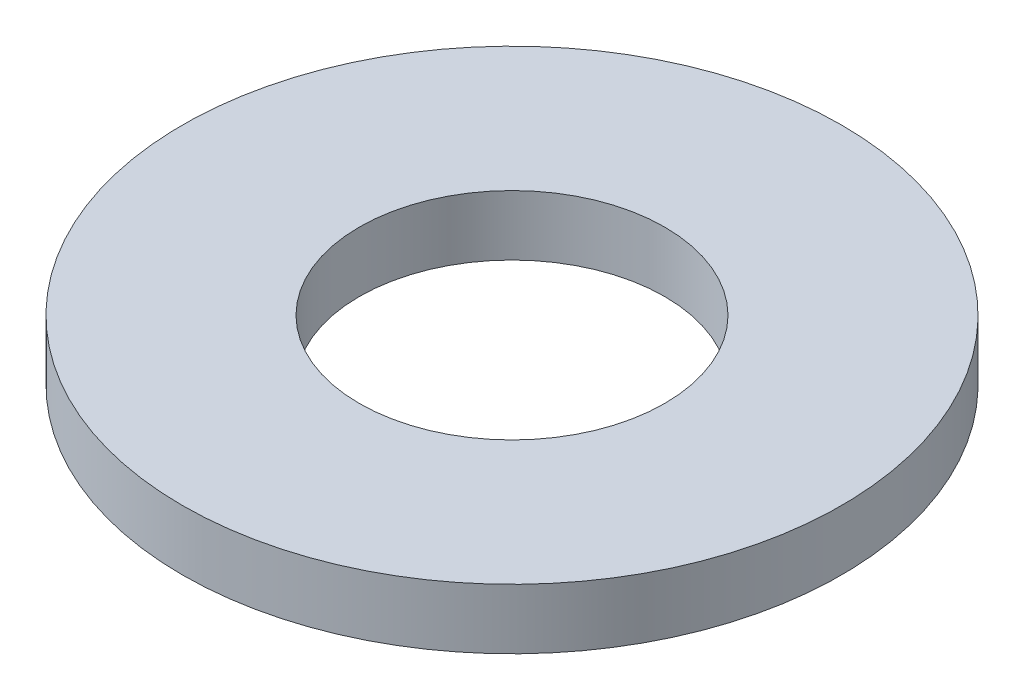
ISO-10303-21;
HEADER;
FILE_DESCRIPTION(('STEP AP214'),'2;1');
FILE_NAME('part.step','',(''),(''),'','','');
FILE_SCHEMA(('AUTOMOTIVE_DESIGN { 1 0 10303 214 1 1 1 1 }'));
ENDSEC;
DATA;
#1=APPLICATION_CONTEXT('core data for automotive mechanical design processes');
#2=APPLICATION_PROTOCOL_DEFINITION('international standard','automotive_design',2000,#1);
#3=PRODUCT_CONTEXT('',#1,'mechanical');
#4=PRODUCT('Part','Part','',(#3));
#5=PRODUCT_RELATED_PRODUCT_CATEGORY('part','',(#4));
#6=PRODUCT_DEFINITION_FORMATION('','',#4);
#7=PRODUCT_DEFINITION_CONTEXT('part definition',#1,'design');
#8=PRODUCT_DEFINITION('design','',#6,#7);
#9=PRODUCT_DEFINITION_SHAPE('','',#8);
#10=(LENGTH_UNIT() NAMED_UNIT(*) SI_UNIT(.MILLI.,.METRE.));
#11=(NAMED_UNIT(*) PLANE_ANGLE_UNIT() SI_UNIT($,.RADIAN.));
#12=(NAMED_UNIT(*) SI_UNIT($,.STERADIAN.) SOLID_ANGLE_UNIT());
#13=UNCERTAINTY_MEASURE_WITH_UNIT(LENGTH_MEASURE(1.E-05),#10,'distance_accuracy_value','');
#14=(GEOMETRIC_REPRESENTATION_CONTEXT(3) GLOBAL_UNCERTAINTY_ASSIGNED_CONTEXT((#13)) GLOBAL_UNIT_ASSIGNED_CONTEXT((#10,
#11,#12)) REPRESENTATION_CONTEXT('',''));
#15=CARTESIAN_POINT('',(0.,0.,0.));
#16=DIRECTION('',(0.,0.,1.));
#17=DIRECTION('',(1.,0.,0.));
#18=AXIS2_PLACEMENT_3D('',#15,#16,#17);
#19=CARTESIAN_POINT('',(0.,0.,0.));
#20=DIRECTION('',(0.,1.,0.));
#21=DIRECTION('',(1.,0.,0.));
#22=AXIS2_PLACEMENT_3D('',#19,#20,#21);
#23=PLANE('',#22);
#24=CARTESIAN_POINT('',(0.,0.,0.));
#25=DIRECTION('',(0.,1.,0.));
#26=DIRECTION('',(0.,0.,1.));
#27=AXIS2_PLACEMENT_3D('',#24,#25,#26);
#28=CIRCLE('',#27,2.5781);
#29=CARTESIAN_POINT('',(0.,0.,2.5781));
#30=VERTEX_POINT('',#29);
#31=EDGE_CURVE('E33',#30,#30,#28,.T.);
#32=ORIENTED_EDGE('',*,*,#31,.T.);
#33=EDGE_LOOP('',(#32));
#34=FACE_BOUND('',#33,.T.);
#35=CARTESIAN_POINT('',(0.,0.,0.));
#36=DIRECTION('',(0.,1.,0.));
#37=DIRECTION('',(0.,0.,1.));
#38=AXIS2_PLACEMENT_3D('',#35,#36,#37);
#39=CIRCLE('',#38,5.5626);
#40=CARTESIAN_POINT('',(0.,0.,5.5626));
#41=VERTEX_POINT('',#40);
#42=EDGE_CURVE('E10',#41,#41,#39,.T.);
#43=ORIENTED_EDGE('',*,*,#42,.F.);
#44=EDGE_LOOP('',(#43));
#45=FACE_BOUND('',#44,.T.);
#46=ADVANCED_FACE('F15',(#34,#45),#23,.F.);
#47=CARTESIAN_POINT('',(0.,1.016,0.));
#48=DIRECTION('',(0.,1.,0.));
#49=DIRECTION('',(1.,0.,0.));
#50=AXIS2_PLACEMENT_3D('',#47,#48,#49);
#51=PLANE('',#50);
#52=CARTESIAN_POINT('',(0.,1.016,0.));
#53=DIRECTION('',(0.,1.,0.));
#54=DIRECTION('',(0.,0.,1.));
#55=AXIS2_PLACEMENT_3D('',#52,#53,#54);
#56=CIRCLE('',#55,2.5781);
#57=CARTESIAN_POINT('',(0.,1.016,2.5781));
#58=VERTEX_POINT('',#57);
#59=EDGE_CURVE('E35',#58,#58,#56,.T.);
#60=ORIENTED_EDGE('',*,*,#59,.F.);
#61=EDGE_LOOP('',(#60));
#62=FACE_BOUND('',#61,.T.);
#63=CARTESIAN_POINT('',(0.,1.016,0.));
#64=DIRECTION('',(0.,1.,0.));
#65=DIRECTION('',(0.,0.,1.));
#66=AXIS2_PLACEMENT_3D('',#63,#64,#65);
#67=CIRCLE('',#66,5.5626);
#68=CARTESIAN_POINT('',(0.,1.016,5.5626));
#69=VERTEX_POINT('',#68);
#70=EDGE_CURVE('E19',#69,#69,#67,.T.);
#71=ORIENTED_EDGE('',*,*,#70,.T.);
#72=EDGE_LOOP('',(#71));
#73=FACE_BOUND('',#72,.T.);
#74=ADVANCED_FACE('F17',(#62,#73),#51,.T.);
#75=CARTESIAN_POINT('',(0.,1.016,0.));
#76=DIRECTION('',(0.,-1.,0.));
#77=DIRECTION('',(0.,0.,-1.));
#78=AXIS2_PLACEMENT_3D('',#75,#76,#77);
#79=CYLINDRICAL_SURFACE('',#78,5.5626);
#80=ORIENTED_EDGE('',*,*,#42,.T.);
#81=EDGE_LOOP('',(#80));
#82=FACE_BOUND('',#81,.T.);
#83=ORIENTED_EDGE('',*,*,#70,.F.);
#84=EDGE_LOOP('',(#83));
#85=FACE_BOUND('',#84,.T.);
#86=ADVANCED_FACE('F52',(#82,#85),#79,.T.);
#87=CARTESIAN_POINT('',(0.,1.016,0.));
#88=DIRECTION('',(0.,-1.,0.));
#89=DIRECTION('',(0.,0.,-1.));
#90=AXIS2_PLACEMENT_3D('',#87,#88,#89);
#91=CYLINDRICAL_SURFACE('',#90,2.5781);
#92=ORIENTED_EDGE('',*,*,#31,.F.);
#93=EDGE_LOOP('',(#92));
#94=FACE_BOUND('',#93,.T.);
#95=ORIENTED_EDGE('',*,*,#59,.T.);
#96=EDGE_LOOP('',(#95));
#97=FACE_BOUND('',#96,.T.);
#98=ADVANCED_FACE('F48',(#94,#97),#91,.F.);
#99=CLOSED_SHELL('',(#46,#74,#86,#98));
#100=MANIFOLD_SOLID_BREP('B1',#99);
#101=ADVANCED_BREP_SHAPE_REPRESENTATION('',(#18,#100),#14);
#102=SHAPE_DEFINITION_REPRESENTATION(#9,#101);
ENDSEC;
END-ISO-10303-21;
